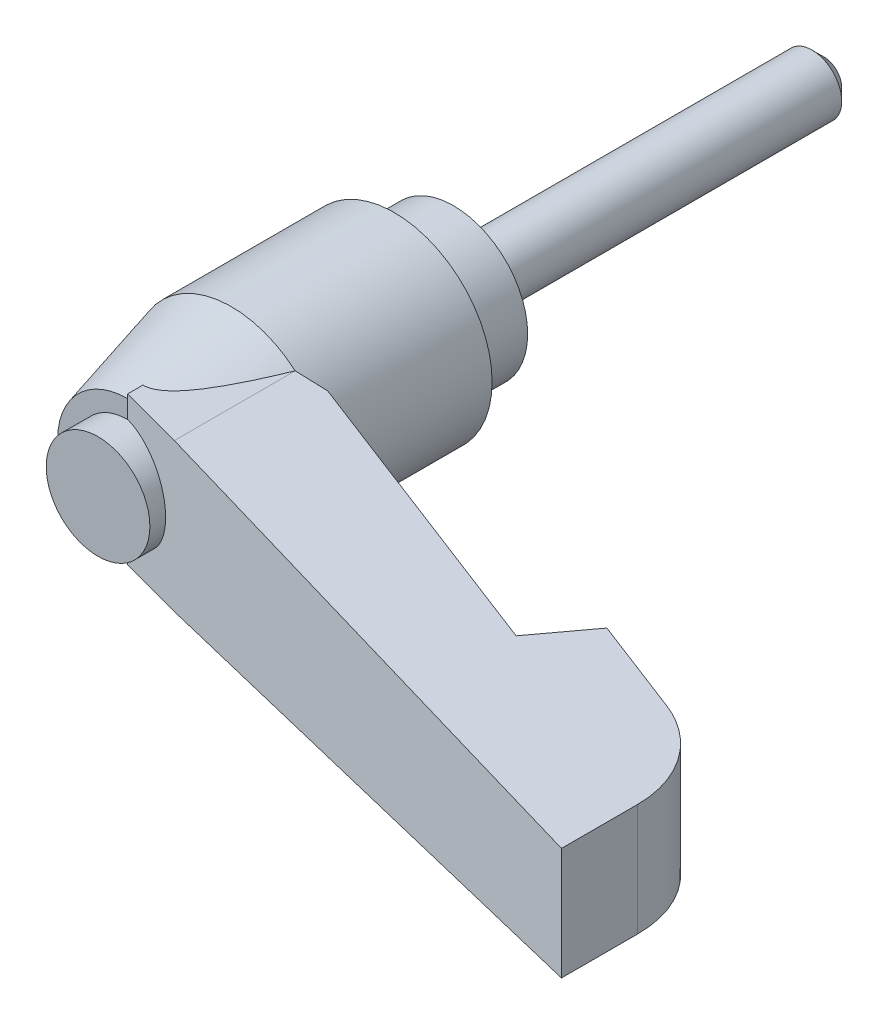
ISO-10303-21;
HEADER;
FILE_DESCRIPTION(('STEP AP214'),'2;1');
FILE_NAME('part.step','',(''),(''),'','','');
FILE_SCHEMA(('AUTOMOTIVE_DESIGN { 1 0 10303 214 1 1 1 1 }'));
ENDSEC;
DATA;
#1=APPLICATION_CONTEXT('core data for automotive mechanical design processes');
#2=APPLICATION_PROTOCOL_DEFINITION('international standard','automotive_design',2000,#1);
#3=PRODUCT_CONTEXT('',#1,'mechanical');
#4=PRODUCT('Part','Part','',(#3));
#5=PRODUCT_RELATED_PRODUCT_CATEGORY('part','',(#4));
#6=PRODUCT_DEFINITION_FORMATION('','',#4);
#7=PRODUCT_DEFINITION_CONTEXT('part definition',#1,'design');
#8=PRODUCT_DEFINITION('design','',#6,#7);
#9=PRODUCT_DEFINITION_SHAPE('','',#8);
#10=(LENGTH_UNIT() NAMED_UNIT(*) SI_UNIT(.MILLI.,.METRE.));
#11=(NAMED_UNIT(*) PLANE_ANGLE_UNIT() SI_UNIT($,.RADIAN.));
#12=(NAMED_UNIT(*) SI_UNIT($,.STERADIAN.) SOLID_ANGLE_UNIT());
#13=UNCERTAINTY_MEASURE_WITH_UNIT(LENGTH_MEASURE(1.E-05),#10,'distance_accuracy_value','');
#14=(GEOMETRIC_REPRESENTATION_CONTEXT(3) GLOBAL_UNCERTAINTY_ASSIGNED_CONTEXT((#13)) GLOBAL_UNIT_ASSIGNED_CONTEXT((#10,
#11,#12)) REPRESENTATION_CONTEXT('',''));
#15=CARTESIAN_POINT('',(0.,0.,0.));
#16=DIRECTION('',(0.,0.,1.));
#17=DIRECTION('',(1.,0.,0.));
#18=AXIS2_PLACEMENT_3D('',#15,#16,#17);
#19=CARTESIAN_POINT('',(2.024,-2.030964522,-25.));
#20=DIRECTION('',(0.,0.,-1.));
#21=DIRECTION('',(-1.,0.,0.));
#22=AXIS2_PLACEMENT_3D('',#19,#20,#21);
#23=PLANE('',#22);
#24=CARTESIAN_POINT('',(0.,0.,-25.));
#25=DIRECTION('',(0.,0.,-1.));
#26=DIRECTION('',(-1.,0.,0.));
#27=AXIS2_PLACEMENT_3D('',#24,#25,#26);
#28=CIRCLE('',#27,1.19999999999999);
#29=CARTESIAN_POINT('',(-1.19999999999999,0.,-25.));
#30=VERTEX_POINT('',#29);
#31=EDGE_CURVE('E9',#30,#30,#28,.T.);
#32=ORIENTED_EDGE('',*,*,#31,.T.);
#33=EDGE_LOOP('',(#32));
#34=FACE_BOUND('',#33,.T.);
#35=ADVANCED_FACE('F14',(#34),#23,.T.);
#36=CARTESIAN_POINT('',(0.,0.,-25.));
#37=DIRECTION('',(0.,0.,1.));
#38=DIRECTION('',(1.,0.,0.));
#39=AXIS2_PLACEMENT_3D('',#36,#37,#38);
#40=CYLINDRICAL_SURFACE('',#39,2.);
#41=CARTESIAN_POINT('',(0.,0.,-24.2));
#42=DIRECTION('',(0.,0.,-1.));
#43=DIRECTION('',(-1.,0.,0.));
#44=AXIS2_PLACEMENT_3D('',#41,#42,#43);
#45=CIRCLE('',#44,2.);
#46=CARTESIAN_POINT('',(-2.,0.,-24.2));
#47=VERTEX_POINT('',#46);
#48=EDGE_CURVE('E23',#47,#47,#45,.F.);
#49=ORIENTED_EDGE('',*,*,#48,.T.);
#50=EDGE_LOOP('',(#49));
#51=FACE_BOUND('',#50,.T.);
#52=CARTESIAN_POINT('',(0.,0.,0.));
#53=DIRECTION('',(0.,0.,1.));
#54=DIRECTION('',(1.,0.,0.));
#55=AXIS2_PLACEMENT_3D('',#52,#53,#54);
#56=CIRCLE('',#55,2.);
#57=CARTESIAN_POINT('',(2.,0.,0.));
#58=VERTEX_POINT('',#57);
#59=EDGE_CURVE('E143',#58,#58,#56,.F.);
#60=ORIENTED_EDGE('',*,*,#59,.T.);
#61=EDGE_LOOP('',(#60));
#62=FACE_BOUND('',#61,.T.);
#63=ADVANCED_FACE('F367',(#51,#62),#40,.T.);
#64=CARTESIAN_POINT('',(-5.06,-5.077411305,0.));
#65=DIRECTION('',(0.,0.,1.));
#66=DIRECTION('',(1.,0.,0.));
#67=AXIS2_PLACEMENT_3D('',#64,#65,#66);
#68=PLANE('',#67);
#69=ORIENTED_EDGE('',*,*,#59,.F.);
#70=EDGE_LOOP('',(#69));
#71=FACE_BOUND('',#70,.T.);
#72=CARTESIAN_POINT('',(0.,0.,0.));
#73=DIRECTION('',(0.,0.,1.));
#74=DIRECTION('',(1.,0.,0.));
#75=AXIS2_PLACEMENT_3D('',#72,#73,#74);
#76=CIRCLE('',#75,5.);
#77=CARTESIAN_POINT('',(5.,0.,0.));
#78=VERTEX_POINT('',#77);
#79=EDGE_CURVE('E122',#78,#78,#76,.T.);
#80=ORIENTED_EDGE('',*,*,#79,.F.);
#81=EDGE_LOOP('',(#80));
#82=FACE_BOUND('',#81,.T.);
#83=ADVANCED_FACE('F369',(#71,#82),#68,.F.);
#84=CARTESIAN_POINT('',(-3.542,-3.554187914,24.));
#85=DIRECTION('',(0.,0.,1.));
#86=DIRECTION('',(1.,0.,0.));
#87=AXIS2_PLACEMENT_3D('',#84,#85,#86);
#88=PLANE('',#87);
#89=CARTESIAN_POINT('',(0.,0.,24.));
#90=DIRECTION('',(0.,0.,1.));
#91=DIRECTION('',(1.,0.,0.));
#92=AXIS2_PLACEMENT_3D('',#89,#90,#91);
#93=CIRCLE('',#92,3.5);
#94=CARTESIAN_POINT('',(3.5,0.,24.));
#95=VERTEX_POINT('',#94);
#96=EDGE_CURVE('E208',#95,#95,#93,.F.);
#97=ORIENTED_EDGE('',*,*,#96,.F.);
#98=EDGE_LOOP('',(#97));
#99=FACE_BOUND('',#98,.T.);
#100=ADVANCED_FACE('F365',(#99),#88,.T.);
#101=CARTESIAN_POINT('',(0.,0.,0.));
#102=DIRECTION('',(0.,0.,1.));
#103=DIRECTION('',(1.,0.,0.));
#104=AXIS2_PLACEMENT_3D('',#101,#102,#103);
#105=CYLINDRICAL_SURFACE('',#104,5.);
#106=CARTESIAN_POINT('',(0.,0.,4.));
#107=DIRECTION('',(0.,0.,1.));
#108=DIRECTION('',(1.,0.,0.));
#109=AXIS2_PLACEMENT_3D('',#106,#107,#108);
#110=CIRCLE('',#109,5.);
#111=CARTESIAN_POINT('',(5.,0.,4.));
#112=VERTEX_POINT('',#111);
#113=EDGE_CURVE('E273',#112,#112,#110,.F.);
#114=ORIENTED_EDGE('',*,*,#113,.T.);
#115=EDGE_LOOP('',(#114));
#116=FACE_BOUND('',#115,.T.);
#117=ORIENTED_EDGE('',*,*,#79,.T.);
#118=EDGE_LOOP('',(#117));
#119=FACE_BOUND('',#118,.T.);
#120=ADVANCED_FACE('F362',(#116,#119),#105,.T.);
#121=CARTESIAN_POINT('',(6.5,1.121419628,15.));
#122=DIRECTION('',(0.,0.,-1.));
#123=DIRECTION('',(-1.,0.,0.));
#124=AXIS2_PLACEMENT_3D('',#121,#122,#123);
#125=PLANE('',#124);
#126=DIRECTION('',(-0.999423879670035,0.0339397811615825,0.));
#127=VECTOR('',#126,1.);
#128=CARTESIAN_POINT('',(22.154065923,4.393963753,15.));
#129=LINE('',#128,#127);
#130=CARTESIAN_POINT('',(6.4999999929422,4.9255655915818,15.));
#131=VERTEX_POINT('',#130);
#132=CARTESIAN_POINT('',(4.30813184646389,4.99999999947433,15.0000000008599));
#133=VERTEX_POINT('',#132);
#134=EDGE_CURVE('E206',#131,#133,#129,.T.);
#135=ORIENTED_EDGE('',*,*,#134,.F.);
#136=DIRECTION('',(0.,1.,0.));
#137=VECTOR('',#136,1.);
#138=CARTESIAN_POINT('',(6.5,0.,15.));
#139=LINE('',#138,#137);
#140=CARTESIAN_POINT('',(6.5,1.14455231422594,15.));
#141=VERTEX_POINT('',#140);
#142=EDGE_CURVE('E203',#141,#131,#139,.T.);
#143=ORIENTED_EDGE('',*,*,#142,.F.);
#144=CARTESIAN_POINT('',(0.,0.,15.));
#145=DIRECTION('',(0.,0.,1.));
#146=DIRECTION('',(1.,0.,0.));
#147=AXIS2_PLACEMENT_3D('',#144,#145,#146);
#148=CIRCLE('',#147,6.6);
#149=EDGE_CURVE('E284',#133,#141,#148,.F.);
#150=ORIENTED_EDGE('',*,*,#149,.F.);
#151=EDGE_LOOP('',(#135,#143,#150));
#152=FACE_BOUND('',#151,.T.);
#153=ADVANCED_FACE('F283',(#152),#125,.T.);
#154=CARTESIAN_POINT('',(33.,3.991671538,27.571700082));
#155=DIRECTION('',(0.,-1.,0.));
#156=DIRECTION('',(0.,0.,-1.));
#157=AXIS2_PLACEMENT_3D('',#154,#155,#156);
#158=CYLINDRICAL_SURFACE('',#157,7.);
#159=CARTESIAN_POINT('',(33.,4.02564292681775,27.571700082));
#160=DIRECTION('',(0.0339397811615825,0.999423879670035,0.));
#161=DIRECTION('',(0.999423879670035,-0.0339397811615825,0.));
#162=AXIS2_PLACEMENT_3D('',#159,#160,#161);
#163=ELLIPSE('',#162,7.00403516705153,7.);
#164=CARTESIAN_POINT('',(40.,3.787927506,27.571700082));
#165=VERTEX_POINT('',#164);
#166=CARTESIAN_POINT('',(35.3941410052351,3.94433946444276,20.9938517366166));
#167=VERTEX_POINT('',#166);
#168=EDGE_CURVE('E115',#165,#167,#163,.T.);
#169=ORIENTED_EDGE('',*,*,#168,.F.);
#170=DIRECTION('',(0.,-1.,0.));
#171=VECTOR('',#170,1.);
#172=CARTESIAN_POINT('',(40.,0.,27.571700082));
#173=LINE('',#172,#171);
#174=CARTESIAN_POINT('',(40.,-3.787927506,27.571700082));
#175=VERTEX_POINT('',#174);
#176=EDGE_CURVE('E106',#165,#175,#173,.T.);
#177=ORIENTED_EDGE('',*,*,#176,.T.);
#178=CARTESIAN_POINT('',(33.,-4.02564292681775,27.571700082));
#179=DIRECTION('',(-0.0339397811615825,0.999423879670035,0.));
#180=DIRECTION('',(-0.999423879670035,-0.0339397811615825,0.));
#181=AXIS2_PLACEMENT_3D('',#178,#179,#180);
#182=ELLIPSE('',#181,7.00403516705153,7.);
#183=CARTESIAN_POINT('',(35.3941410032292,-3.94433946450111,20.9938517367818));
#184=VERTEX_POINT('',#183);
#185=EDGE_CURVE('E118',#175,#184,#182,.T.);
#186=ORIENTED_EDGE('',*,*,#185,.T.);
#187=DIRECTION('',(0.,-1.,0.));
#188=VECTOR('',#187,1.);
#189=CARTESIAN_POINT('',(35.394141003,0.,20.993851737));
#190=LINE('',#189,#188);
#191=EDGE_CURVE('E111',#167,#184,#190,.T.);
#192=ORIENTED_EDGE('',*,*,#191,.F.);
#193=EDGE_LOOP('',(#169,#177,#186,#192));
#194=FACE_BOUND('',#193,.T.);
#195=ADVANCED_FACE('F113',(#194),#158,.T.);
#196=CARTESIAN_POINT('',(35.394141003,-4.210603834,20.993851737));
#197=DIRECTION('',(0.342020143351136,0.,-0.939692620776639));
#198=DIRECTION('',(-0.939692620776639,0.,-0.342020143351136));
#199=AXIS2_PLACEMENT_3D('',#196,#197,#198);
#200=PLANE('',#199);
#201=DIRECTION('',(-0.939214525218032,0.0318951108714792,-0.341846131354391));
#202=VECTOR('',#201,1.);
#203=CARTESIAN_POINT('',(35.3941410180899,3.944339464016,20.9938517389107));
#204=LINE('',#203,#202);
#205=CARTESIAN_POINT('',(29.0236925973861,4.16067572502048,18.67519813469));
#206=VERTEX_POINT('',#205);
#207=EDGE_CURVE('E125',#167,#206,#204,.T.);
#208=ORIENTED_EDGE('',*,*,#207,.F.);
#209=ORIENTED_EDGE('',*,*,#191,.T.);
#210=DIRECTION('',(-0.939214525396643,-0.0318951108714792,-0.341846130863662));
#211=VECTOR('',#210,1.);
#212=CARTESIAN_POINT('',(35.3941410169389,-3.944339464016,20.9938517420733));
#213=LINE('',#212,#211);
#214=CARTESIAN_POINT('',(29.023692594,-4.16067572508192,18.675198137));
#215=VERTEX_POINT('',#214);
#216=EDGE_CURVE('E300',#184,#215,#213,.T.);
#217=ORIENTED_EDGE('',*,*,#216,.T.);
#218=DIRECTION('',(0.,-1.,0.));
#219=VECTOR('',#218,1.);
#220=CARTESIAN_POINT('',(29.023692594,0.,18.675198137));
#221=LINE('',#220,#219);
#222=EDGE_CURVE('E121',#206,#215,#221,.T.);
#223=ORIENTED_EDGE('',*,*,#222,.F.);
#224=EDGE_LOOP('',(#208,#209,#217,#223));
#225=FACE_BOUND('',#224,.T.);
#226=ADVANCED_FACE('F126',(#225),#200,.T.);
#227=CARTESIAN_POINT('',(29.023692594,-4.297335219,18.675198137));
#228=DIRECTION('',(-0.819152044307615,0.,-0.57357643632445));
#229=DIRECTION('',(-0.57357643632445,0.,0.819152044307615));
#230=AXIS2_PLACEMENT_3D('',#227,#228,#229);
#231=PLANE('',#230);
#232=DIRECTION('',(-0.573467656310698,0.0194745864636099,0.818996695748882));
#233=VECTOR('',#232,1.);
#234=CARTESIAN_POINT('',(29.0236925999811,4.16067572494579,18.675198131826));
#235=LINE('',#234,#233);
#236=CARTESIAN_POINT('',(26.5000000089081,4.2463786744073,22.2794046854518));
#237=VERTEX_POINT('',#236);
#238=EDGE_CURVE('E131',#206,#237,#235,.T.);
#239=ORIENTED_EDGE('',*,*,#238,.F.);
#240=ORIENTED_EDGE('',*,*,#222,.T.);
#241=DIRECTION('',(-0.573467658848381,-0.0194745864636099,0.818996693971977));
#242=VECTOR('',#241,1.);
#243=CARTESIAN_POINT('',(29.0236925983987,-4.16067572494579,18.675198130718));
#244=LINE('',#243,#242);
#245=CARTESIAN_POINT('',(26.5,-4.24637867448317,22.279404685));
#246=VERTEX_POINT('',#245);
#247=EDGE_CURVE('E302',#215,#246,#244,.T.);
#248=ORIENTED_EDGE('',*,*,#247,.T.);
#249=DIRECTION('',(0.,-1.,0.));
#250=VECTOR('',#249,1.);
#251=CARTESIAN_POINT('',(26.5,0.,22.279404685));
#252=LINE('',#251,#250);
#253=EDGE_CURVE('E200',#237,#246,#252,.T.);
#254=ORIENTED_EDGE('',*,*,#253,.F.);
#255=EDGE_LOOP('',(#239,#240,#248,#254));
#256=FACE_BOUND('',#255,.T.);
#257=ADVANCED_FACE('F507',(#256),#231,.T.);
#258=CARTESIAN_POINT('',(26.5,-4.984672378,22.279404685));
#259=DIRECTION('',(0.342020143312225,0.,-0.939692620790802));
#260=DIRECTION('',(-0.939692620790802,0.,-0.342020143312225));
#261=AXIS2_PLACEMENT_3D('',#258,#259,#260);
#262=PLANE('',#261);
#263=DIRECTION('',(-0.939214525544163,0.0318951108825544,-0.341846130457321));
#264=VECTOR('',#263,1.);
#265=CARTESIAN_POINT('',(26.5000000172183,4.24637867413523,22.2794046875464));
#266=LINE('',#265,#264);
#267=EDGE_CURVE('E209',#237,#131,#266,.T.);
#268=ORIENTED_EDGE('',*,*,#267,.F.);
#269=ORIENTED_EDGE('',*,*,#253,.T.);
#270=DIRECTION('',(-0.939214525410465,-0.0318951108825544,-0.34184613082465));
#271=VECTOR('',#270,1.);
#272=CARTESIAN_POINT('',(26.5000000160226,-4.24637867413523,22.2794046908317));
#273=LINE('',#272,#271);
#274=CARTESIAN_POINT('',(6.5,-4.92556559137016,15.));
#275=VERTEX_POINT('',#274);
#276=EDGE_CURVE('E172',#246,#275,#273,.T.);
#277=ORIENTED_EDGE('',*,*,#276,.T.);
#278=DIRECTION('',(0.,-1.,0.));
#279=VECTOR('',#278,1.);
#280=CARTESIAN_POINT('',(6.5,-3.072276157,15.));
#281=LINE('',#280,#279);
#282=CARTESIAN_POINT('',(6.50000000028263,-1.1445523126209,15.));
#283=VERTEX_POINT('',#282);
#284=EDGE_CURVE('E265',#283,#275,#281,.T.);
#285=ORIENTED_EDGE('',*,*,#284,.F.);
#286=CARTESIAN_POINT('',(-0.712266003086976,0.,12.3749498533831));
#287=DIRECTION('',(0.342020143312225,0.,-0.939692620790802));
#288=DIRECTION('',(-0.939692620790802,0.,-0.342020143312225));
#289=AXIS2_PLACEMENT_3D('',#286,#287,#288);
#290=ELLIPSE('',#289,7.77209472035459,7.26856501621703);
#291=CARTESIAN_POINT('',(6.59542722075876,-3.94812923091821E-10,15.0145038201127));
#292=VERTEX_POINT('',#291);
#293=EDGE_CURVE('E31',#292,#283,#290,.T.);
#294=ORIENTED_EDGE('',*,*,#293,.F.);
#295=CARTESIAN_POINT('',(0.,0.,12.634193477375));
#296=DIRECTION('',(0.342020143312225,0.,-0.939692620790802));
#297=DIRECTION('',(0.939692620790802,0.,0.342020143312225));
#298=AXIS2_PLACEMENT_3D('',#295,#296,#297);
#299=ELLIPSE('',#298,7.02357329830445,6.6);
#300=EDGE_CURVE('E279',#141,#292,#299,.T.);
#301=ORIENTED_EDGE('',*,*,#300,.F.);
#302=ORIENTED_EDGE('',*,*,#142,.T.);
#303=EDGE_LOOP('',(#268,#269,#277,#285,#294,#301,#302));
#304=FACE_BOUND('',#303,.T.);
#305=ADVANCED_FACE('F277',(#304),#262,.T.);
#306=CARTESIAN_POINT('',(40.,-3.787927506,27.571700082));
#307=DIRECTION('',(-1.,0.,0.));
#308=DIRECTION('',(0.,0.,1.));
#309=AXIS2_PLACEMENT_3D('',#306,#307,#308);
#310=PLANE('',#309);
#311=DIRECTION('',(0.,0.,-1.));
#312=VECTOR('',#311,1.);
#313=CARTESIAN_POINT('',(40.,-3.787927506,23.9121377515));
#314=LINE('',#313,#312);
#315=CARTESIAN_POINT('',(40.,-3.787927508,32.717967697));
#316=VERTEX_POINT('',#315);
#317=EDGE_CURVE('E263',#316,#175,#314,.T.);
#318=ORIENTED_EDGE('',*,*,#317,.T.);
#319=ORIENTED_EDGE('',*,*,#176,.F.);
#320=DIRECTION('',(0.,0.,-1.));
#321=VECTOR('',#320,1.);
#322=CARTESIAN_POINT('',(40.,3.787927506,23.9121377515));
#323=LINE('',#322,#321);
#324=CARTESIAN_POINT('',(40.,3.787927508,32.717967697));
#325=VERTEX_POINT('',#324);
#326=EDGE_CURVE('E136',#325,#165,#323,.T.);
#327=ORIENTED_EDGE('',*,*,#326,.F.);
#328=DIRECTION('',(0.,1.,0.));
#329=VECTOR('',#328,1.);
#330=CARTESIAN_POINT('',(40.,0.,32.717967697));
#331=LINE('',#330,#329);
#332=EDGE_CURVE('E197',#316,#325,#331,.T.);
#333=ORIENTED_EDGE('',*,*,#332,.F.);
#334=EDGE_LOOP('',(#318,#319,#327,#333));
#335=FACE_BOUND('',#334,.T.);
#336=ADVANCED_FACE('F525',(#335),#310,.F.);
#337=CARTESIAN_POINT('',(40.,3.787927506,15.));
#338=DIRECTION('',(0.0339397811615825,0.999423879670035,0.));
#339=DIRECTION('',(-0.999423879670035,0.0339397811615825,0.));
#340=AXIS2_PLACEMENT_3D('',#337,#338,#339);
#341=PLANE('',#340);
#342=ORIENTED_EDGE('',*,*,#267,.T.);
#343=ORIENTED_EDGE('',*,*,#134,.T.);
#344=DIRECTION('',(0.,0.,1.));
#345=VECTOR('',#344,1.);
#346=CARTESIAN_POINT('',(4.308131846,5.,19.0771802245));
#347=LINE('',#346,#345);
#348=CARTESIAN_POINT('',(4.30813184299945,5.,23.1543604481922));
#349=VERTEX_POINT('',#348);
#350=EDGE_CURVE('E272',#133,#349,#347,.T.);
#351=ORIENTED_EDGE('',*,*,#350,.T.);
#352=DIRECTION('',(-0.965406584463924,0.0327845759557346,-0.258679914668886));
#353=VECTOR('',#352,1.);
#354=CARTESIAN_POINT('',(40.,3.78792751,32.717967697));
#355=LINE('',#354,#353);
#356=EDGE_CURVE('E194',#325,#349,#355,.T.);
#357=ORIENTED_EDGE('',*,*,#356,.F.);
#358=ORIENTED_EDGE('',*,*,#326,.T.);
#359=ORIENTED_EDGE('',*,*,#168,.T.);
#360=ORIENTED_EDGE('',*,*,#207,.T.);
#361=ORIENTED_EDGE('',*,*,#238,.T.);
#362=EDGE_LOOP('',(#342,#343,#351,#357,#358,#359,#360,#361));
#363=FACE_BOUND('',#362,.T.);
#364=ADVANCED_FACE('F134',(#363),#341,.T.);
#365=CARTESIAN_POINT('',(0.,0.,22.));
#366=DIRECTION('',(0.,0.,1.));
#367=DIRECTION('',(1.,0.,0.));
#368=AXIS2_PLACEMENT_3D('',#365,#366,#367);
#369=CYLINDRICAL_SURFACE('',#368,3.5);
#370=CARTESIAN_POINT('',(0.,0.,22.));
#371=DIRECTION('',(-0.258819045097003,0.,0.965925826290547));
#372=DIRECTION('',(0.965925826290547,0.,0.258819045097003));
#373=AXIS2_PLACEMENT_3D('',#370,#371,#372);
#374=ELLIPSE('',#373,3.62346663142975,3.5);
#375=CARTESIAN_POINT('',(0.,3.5,22.));
#376=VERTEX_POINT('',#375);
#377=CARTESIAN_POINT('',(0.,-3.5,22.));
#378=VERTEX_POINT('',#377);
#379=EDGE_CURVE('E188',#376,#378,#374,.F.);
#380=ORIENTED_EDGE('',*,*,#379,.F.);
#381=CARTESIAN_POINT('',(0.,0.,22.));
#382=DIRECTION('',(0.,0.,1.));
#383=DIRECTION('',(1.,0.,0.));
#384=AXIS2_PLACEMENT_3D('',#381,#382,#383);
#385=CIRCLE('',#384,3.5);
#386=EDGE_CURVE('E254',#376,#378,#385,.T.);
#387=ORIENTED_EDGE('',*,*,#386,.T.);
#388=EDGE_LOOP('',(#380,#387));
#389=FACE_BOUND('',#388,.T.);
#390=ORIENTED_EDGE('',*,*,#96,.T.);
#391=EDGE_LOOP('',(#390));
#392=FACE_BOUND('',#391,.T.);
#393=ADVANCED_FACE('F356',(#389,#392),#369,.T.);
#394=CARTESIAN_POINT('',(0.,4.722701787,20.96510898));
#395=DIRECTION('',(-1.,0.,0.));
#396=DIRECTION('',(0.,0.,1.));
#397=AXIS2_PLACEMENT_3D('',#394,#395,#396);
#398=PLANE('',#397);
#399=DIRECTION('',(0.,-1.,0.));
#400=VECTOR('',#399,1.);
#401=CARTESIAN_POINT('',(0.,0.,22.));
#402=LINE('',#401,#400);
#403=CARTESIAN_POINT('',(0.,5.,22.00000000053));
#404=VERTEX_POINT('',#403);
#405=CARTESIAN_POINT('',(4.8449077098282E-10,4.7243556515,22.));
#406=VERTEX_POINT('',#405);
#407=EDGE_CURVE('E185',#404,#406,#402,.T.);
#408=ORIENTED_EDGE('',*,*,#407,.F.);
#409=DIRECTION('',(0.,0.,-1.));
#410=VECTOR('',#409,1.);
#411=CARTESIAN_POINT('',(0.,5.,19.0771802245));
#412=LINE('',#411,#410);
#413=CARTESIAN_POINT('',(2.56379285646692E-10,5.,20.9712812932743));
#414=VERTEX_POINT('',#413);
#415=EDGE_CURVE('E270',#404,#414,#412,.T.);
#416=ORIENTED_EDGE('',*,*,#415,.T.);
#417=DIRECTION('',(5.3084673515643E-11,0.258819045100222,-0.965925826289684));
#418=VECTOR('',#417,1.);
#419=CARTESIAN_POINT('',(1.16133208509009E-09,5.6621778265,18.5));
#420=LINE('',#419,#418);
#421=EDGE_CURVE('E180',#406,#414,#420,.T.);
#422=ORIENTED_EDGE('',*,*,#421,.F.);
#423=EDGE_LOOP('',(#408,#416,#422));
#424=FACE_BOUND('',#423,.T.);
#425=ADVANCED_FACE('F323',(#424),#398,.T.);
#426=CARTESIAN_POINT('',(0.,5.,23.203286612));
#427=DIRECTION('',(0.,-1.,0.));
#428=DIRECTION('',(0.,0.,-1.));
#429=AXIS2_PLACEMENT_3D('',#426,#427,#428);
#430=PLANE('',#429);
#431=ORIENTED_EDGE('',*,*,#350,.F.);
#432=CARTESIAN_POINT('',(5.12758570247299E-10,4.99999999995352,20.9712812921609));
#433=CARTESIAN_POINT('',(0.0452169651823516,4.99999999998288,20.9713050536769));
#434=CARTESIAN_POINT('',(0.0904012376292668,4.99999999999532,20.9689904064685));
#435=CARTESIAN_POINT('',(0.180236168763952,5.00000000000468,20.9599070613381));
#436=CARTESIAN_POINT('',(0.224887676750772,5.00000000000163,20.9531468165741));
#437=CARTESIAN_POINT('',(0.355879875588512,4.9999999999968,20.9268621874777));
#438=CARTESIAN_POINT('',(0.441043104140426,4.99999999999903,20.9013147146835));
#439=CARTESIAN_POINT('',(0.632227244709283,5.00000000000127,20.8270446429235));
#440=CARTESIAN_POINT('',(0.736330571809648,5.00000000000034,20.7735488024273));
#441=CARTESIAN_POINT('',(0.935669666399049,4.99999999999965,20.6509465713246));
#442=CARTESIAN_POINT('',(1.03082413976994,4.9999999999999,20.5817135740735));
#443=CARTESIAN_POINT('',(1.23366330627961,5.00000000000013,20.4160087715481));
#444=CARTESIAN_POINT('',(1.33918187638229,5.00000000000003,20.3169366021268));
#445=CARTESIAN_POINT('',(1.54038525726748,4.99999999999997,20.1091453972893));
#446=CARTESIAN_POINT('',(1.63605047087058,4.99999999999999,20.0004079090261));
#447=CARTESIAN_POINT('',(1.82048892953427,5.00000000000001,19.7755785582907));
#448=CARTESIAN_POINT('',(1.9091882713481,5.,19.6594267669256));
#449=CARTESIAN_POINT('',(2.08029219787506,5.,19.4227906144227));
#450=CARTESIAN_POINT('',(2.16270259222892,5.,19.302310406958));
#451=CARTESIAN_POINT('',(2.35274250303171,5.,19.0120714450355));
#452=CARTESIAN_POINT('',(2.4581571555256,5.,18.8408691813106));
#453=CARTESIAN_POINT('',(2.66191601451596,5.,18.494284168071));
#454=CARTESIAN_POINT('',(2.76025796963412,5.,18.3189001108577));
#455=CARTESIAN_POINT('',(2.95155424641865,5.,17.9648132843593));
#456=CARTESIAN_POINT('',(3.04449826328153,5.,17.7861049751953));
#457=CARTESIAN_POINT('',(3.22591068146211,5.,17.4264286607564));
#458=CARTESIAN_POINT('',(3.31437881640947,5.,17.2454605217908));
#459=CARTESIAN_POINT('',(3.48198701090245,5.,16.8936485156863));
#460=CARTESIAN_POINT('',(3.56135902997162,5.,16.7229147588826));
#461=CARTESIAN_POINT('',(3.71739787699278,5.,16.3802085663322));
#462=CARTESIAN_POINT('',(3.79406458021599,5.,16.2082360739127));
#463=CARTESIAN_POINT('',(3.94476452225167,5.,15.8640185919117));
#464=CARTESIAN_POINT('',(4.01880761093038,5.,15.6917779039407));
#465=CARTESIAN_POINT('',(4.16489312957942,5.,15.3464724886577));
#466=CARTESIAN_POINT('',(4.23693578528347,5.,15.1734078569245));
#467=CARTESIAN_POINT('',(4.3081318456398,5.,15.0000000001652));
#468=B_SPLINE_CURVE_WITH_KNOTS('',3,(#432,#433,#434,#435,#436,#437,#438,#439,#440,#441,#442,
#443,#444,#445,#446,#447,#448,#449,#450,#451,#452,#453,#454,#455,#456,#457,#458,#459,#460,#461,
#462,#463,#464,#465,#466,#467),.UNSPECIFIED.,.F.,.F.,(4,2,2,2,2,2,2,2,2,2,2,2,2,2,2,2,2,4),(0.,
0.135533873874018,0.270810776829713,0.536101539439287,0.885260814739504,1.23733529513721,
1.67054898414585,2.10460829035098,2.54278097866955,2.98054386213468,3.58345671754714,
4.18656065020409,4.79078044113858,5.39503614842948,5.95985360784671,6.52469707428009,
7.08712785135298,7.6494949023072),.UNSPECIFIED.);
#469=EDGE_CURVE('E183',#414,#133,#468,.T.);
#470=ORIENTED_EDGE('',*,*,#469,.F.);
#471=ORIENTED_EDGE('',*,*,#415,.F.);
#472=DIRECTION('',(-0.965925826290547,0.,-0.258819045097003));
#473=VECTOR('',#472,1.);
#474=CARTESIAN_POINT('',(20.,5.,27.3589838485));
#475=LINE('',#474,#473);
#476=EDGE_CURVE('E189',#349,#404,#475,.T.);
#477=ORIENTED_EDGE('',*,*,#476,.F.);
#478=EDGE_LOOP('',(#431,#470,#471,#477));
#479=FACE_BOUND('',#478,.T.);
#480=ADVANCED_FACE('F317',(#479),#430,.F.);
#481=CARTESIAN_POINT('',(-6.6792,-6.702182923,4.));
#482=DIRECTION('',(0.,0.,1.));
#483=DIRECTION('',(1.,0.,0.));
#484=AXIS2_PLACEMENT_3D('',#481,#482,#483);
#485=PLANE('',#484);
#486=ORIENTED_EDGE('',*,*,#113,.F.);
#487=EDGE_LOOP('',(#486));
#488=FACE_BOUND('',#487,.T.);
#489=CARTESIAN_POINT('',(0.,0.,4.));
#490=DIRECTION('',(0.,0.,1.));
#491=DIRECTION('',(1.,0.,0.));
#492=AXIS2_PLACEMENT_3D('',#489,#490,#491);
#493=CIRCLE('',#492,6.6);
#494=CARTESIAN_POINT('',(6.6,0.,4.));
#495=VERTEX_POINT('',#494);
#496=EDGE_CURVE('E177',#495,#495,#493,.T.);
#497=ORIENTED_EDGE('',*,*,#496,.F.);
#498=EDGE_LOOP('',(#497));
#499=FACE_BOUND('',#498,.T.);
#500=ADVANCED_FACE('F322',(#488,#499),#485,.F.);
#501=CARTESIAN_POINT('',(0.,0.,15.022195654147));
#502=DIRECTION('',(0.,0.,-1.));
#503=DIRECTION('',(-1.,0.,0.));
#504=AXIS2_PLACEMENT_3D('',#501,#502,#503);
#505=CONICAL_SURFACE('',#504,6.594052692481,0.261799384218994);
#506=CARTESIAN_POINT('',(0.,0.,15.));
#507=DIRECTION('',(0.,0.,1.));
#508=DIRECTION('',(1.,0.,0.));
#509=AXIS2_PLACEMENT_3D('',#506,#507,#508);
#510=CIRCLE('',#509,6.6);
#511=EDGE_CURVE('E173',#292,#283,#510,.F.);
#512=ORIENTED_EDGE('',*,*,#511,.F.);
#513=ORIENTED_EDGE('',*,*,#293,.T.);
#514=EDGE_LOOP('',(#512,#513));
#515=FACE_BOUND('',#514,.T.);
#516=ADVANCED_FACE('F328',(#515),#505,.T.);
#517=CARTESIAN_POINT('',(6.5,-5.023132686,15.));
#518=DIRECTION('',(0.,0.,-1.));
#519=DIRECTION('',(-1.,0.,0.));
#520=AXIS2_PLACEMENT_3D('',#517,#518,#519);
#521=PLANE('',#520);
#522=CARTESIAN_POINT('',(0.,0.,15.));
#523=DIRECTION('',(0.,0.,1.));
#524=DIRECTION('',(1.,0.,0.));
#525=AXIS2_PLACEMENT_3D('',#522,#523,#524);
#526=CIRCLE('',#525,6.6);
#527=CARTESIAN_POINT('',(4.30813184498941,-5.00000000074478,14.9999999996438));
#528=VERTEX_POINT('',#527);
#529=EDGE_CURVE('E176',#283,#528,#526,.F.);
#530=ORIENTED_EDGE('',*,*,#529,.F.);
#531=ORIENTED_EDGE('',*,*,#284,.T.);
#532=DIRECTION('',(-0.999423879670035,-0.0339397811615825,0.));
#533=VECTOR('',#532,1.);
#534=CARTESIAN_POINT('',(22.154065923,-4.393963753,15.));
#535=LINE('',#534,#533);
#536=EDGE_CURVE('E169',#275,#528,#535,.T.);
#537=ORIENTED_EDGE('',*,*,#536,.T.);
#538=EDGE_LOOP('',(#530,#531,#537));
#539=FACE_BOUND('',#538,.T.);
#540=ADVANCED_FACE('F330',(#539),#521,.T.);
#541=CARTESIAN_POINT('',(40.,-3.787927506,15.));
#542=DIRECTION('',(-0.0339397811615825,0.999423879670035,0.));
#543=DIRECTION('',(-0.999423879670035,-0.0339397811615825,0.));
#544=AXIS2_PLACEMENT_3D('',#541,#542,#543);
#545=PLANE('',#544);
#546=DIRECTION('',(0.,0.,1.));
#547=VECTOR('',#546,1.);
#548=CARTESIAN_POINT('',(4.308131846,-5.,19.0771802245));
#549=LINE('',#548,#547);
#550=CARTESIAN_POINT('',(4.30813184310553,-4.99999999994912,23.1543604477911));
#551=VERTEX_POINT('',#550);
#552=EDGE_CURVE('E244',#528,#551,#549,.T.);
#553=ORIENTED_EDGE('',*,*,#552,.F.);
#554=ORIENTED_EDGE('',*,*,#536,.F.);
#555=ORIENTED_EDGE('',*,*,#276,.F.);
#556=ORIENTED_EDGE('',*,*,#247,.F.);
#557=ORIENTED_EDGE('',*,*,#216,.F.);
#558=ORIENTED_EDGE('',*,*,#185,.F.);
#559=ORIENTED_EDGE('',*,*,#317,.F.);
#560=DIRECTION('',(0.965406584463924,0.0327845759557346,0.258679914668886));
#561=VECTOR('',#560,1.);
#562=CARTESIAN_POINT('',(4.30813184,-5.,23.1543604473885));
#563=LINE('',#562,#561);
#564=EDGE_CURVE('E171',#551,#316,#563,.T.);
#565=ORIENTED_EDGE('',*,*,#564,.F.);
#566=EDGE_LOOP('',(#553,#554,#555,#556,#557,#558,#559,#565));
#567=FACE_BOUND('',#566,.T.);
#568=ADVANCED_FACE('F333',(#567),#545,.F.);
#569=CARTESIAN_POINT('',(0.,-5.,22.));
#570=DIRECTION('',(-0.258819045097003,0.,0.965925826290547));
#571=DIRECTION('',(0.965925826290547,0.,0.258819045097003));
#572=AXIS2_PLACEMENT_3D('',#569,#570,#571);
#573=PLANE('',#572);
#574=DIRECTION('',(0.,1.,0.));
#575=VECTOR('',#574,1.);
#576=CARTESIAN_POINT('',(0.,-4.8613508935,22.));
#577=LINE('',#576,#575);
#578=CARTESIAN_POINT('',(0.,-5.,22.0000000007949));
#579=VERTEX_POINT('',#578);
#580=CARTESIAN_POINT('',(9.0870570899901E-10,-4.72435565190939,22.));
#581=VERTEX_POINT('',#580);
#582=EDGE_CURVE('E164',#579,#581,#577,.T.);
#583=ORIENTED_EDGE('',*,*,#582,.F.);
#584=DIRECTION('',(-0.965925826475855,0.,-0.258819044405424));
#585=VECTOR('',#584,1.);
#586=CARTESIAN_POINT('',(4.308131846,-5.,23.1543604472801));
#587=LINE('',#586,#585);
#588=EDGE_CURVE('E165',#551,#579,#587,.T.);
#589=ORIENTED_EDGE('',*,*,#588,.F.);
#590=ORIENTED_EDGE('',*,*,#564,.T.);
#591=ORIENTED_EDGE('',*,*,#332,.T.);
#592=ORIENTED_EDGE('',*,*,#356,.T.);
#593=ORIENTED_EDGE('',*,*,#476,.T.);
#594=ORIENTED_EDGE('',*,*,#407,.T.);
#595=DIRECTION('',(0.,-1.,0.));
#596=VECTOR('',#595,1.);
#597=CARTESIAN_POINT('',(0.,0.,22.));
#598=LINE('',#597,#596);
#599=EDGE_CURVE('E257',#406,#376,#598,.T.);
#600=ORIENTED_EDGE('',*,*,#599,.T.);
#601=ORIENTED_EDGE('',*,*,#379,.T.);
#602=DIRECTION('',(0.,-1.,0.));
#603=VECTOR('',#602,1.);
#604=CARTESIAN_POINT('',(0.,0.,22.));
#605=LINE('',#604,#603);
#606=EDGE_CURVE('E184',#378,#581,#605,.T.);
#607=ORIENTED_EDGE('',*,*,#606,.T.);
#608=EDGE_LOOP('',(#583,#589,#590,#591,#592,#593,#594,#600,#601,#607));
#609=FACE_BOUND('',#608,.T.);
#610=ADVANCED_FACE('F247',(#609),#573,.T.);
#611=CARTESIAN_POINT('',(0.,-4.781047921,22.));
#612=DIRECTION('',(0.,0.,-1.));
#613=DIRECTION('',(-1.,0.,0.));
#614=AXIS2_PLACEMENT_3D('',#611,#612,#613);
#615=PLANE('',#614);
#616=CARTESIAN_POINT('',(0.,0.,22.));
#617=DIRECTION('',(0.,0.,-1.));
#618=DIRECTION('',(-1.,0.,0.));
#619=AXIS2_PLACEMENT_3D('',#616,#617,#618);
#620=CIRCLE('',#619,4.724355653);
#621=EDGE_CURVE('E168',#581,#406,#620,.T.);
#622=ORIENTED_EDGE('',*,*,#621,.F.);
#623=ORIENTED_EDGE('',*,*,#606,.F.);
#624=ORIENTED_EDGE('',*,*,#386,.F.);
#625=ORIENTED_EDGE('',*,*,#599,.F.);
#626=EDGE_LOOP('',(#622,#623,#624,#625));
#627=FACE_BOUND('',#626,.T.);
#628=ADVANCED_FACE('F229',(#627),#615,.F.);
#629=CARTESIAN_POINT('',(0.,0.,4.));
#630=DIRECTION('',(0.,0.,1.));
#631=DIRECTION('',(1.,0.,0.));
#632=AXIS2_PLACEMENT_3D('',#629,#630,#631);
#633=CYLINDRICAL_SURFACE('',#632,6.6);
#634=ORIENTED_EDGE('',*,*,#496,.T.);
#635=EDGE_LOOP('',(#634));
#636=FACE_BOUND('',#635,.T.);
#637=ORIENTED_EDGE('',*,*,#529,.T.);
#638=CARTESIAN_POINT('',(0.,0.,15.));
#639=DIRECTION('',(0.,0.,-1.));
#640=DIRECTION('',(-1.,0.,0.));
#641=AXIS2_PLACEMENT_3D('',#638,#639,#640);
#642=CIRCLE('',#641,6.6);
#643=EDGE_CURVE('E155',#133,#528,#642,.F.);
#644=ORIENTED_EDGE('',*,*,#643,.F.);
#645=ORIENTED_EDGE('',*,*,#149,.T.);
#646=ORIENTED_EDGE('',*,*,#300,.T.);
#647=ORIENTED_EDGE('',*,*,#511,.T.);
#648=EDGE_LOOP('',(#637,#644,#645,#646,#647));
#649=FACE_BOUND('',#648,.T.);
#650=ADVANCED_FACE('F227',(#636,#649),#633,.T.);
#651=CARTESIAN_POINT('',(0.,-5.,23.203286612));
#652=DIRECTION('',(0.,-1.,0.));
#653=DIRECTION('',(0.,0.,-1.));
#654=AXIS2_PLACEMENT_3D('',#651,#652,#653);
#655=PLANE('',#654);
#656=DIRECTION('',(0.,0.,1.));
#657=VECTOR('',#656,1.);
#658=CARTESIAN_POINT('',(0.,-5.,21.48255449));
#659=LINE('',#658,#657);
#660=CARTESIAN_POINT('',(9.61724492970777E-10,-5.,20.9712812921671));
#661=VERTEX_POINT('',#660);
#662=EDGE_CURVE('E161',#661,#579,#659,.T.);
#663=ORIENTED_EDGE('',*,*,#662,.F.);
#664=CARTESIAN_POINT('',(4.30813184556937,-4.99999999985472,15.0000000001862));
#665=CARTESIAN_POINT('',(4.22695317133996,-4.99999999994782,15.1977035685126));
#666=CARTESIAN_POINT('',(4.14468257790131,-4.99999999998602,15.3949657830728));
#667=CARTESIAN_POINT('',(3.97748181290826,-5.00000000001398,15.788403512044));
#668=CARTESIAN_POINT('',(3.89255113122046,-5.00000000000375,15.9845788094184));
#669=CARTESIAN_POINT('',(3.71969315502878,-4.99999999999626,16.3753187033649));
#670=CARTESIAN_POINT('',(3.63176972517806,-4.99999999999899,16.5698850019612));
#671=CARTESIAN_POINT('',(3.45219836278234,-5.00000000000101,16.9572716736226));
#672=CARTESIAN_POINT('',(3.36055072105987,-5.0000000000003,17.1500921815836));
#673=CARTESIAN_POINT('',(3.1396904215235,-4.99999999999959,17.6009656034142));
#674=CARTESIAN_POINT('',(3.00860107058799,-4.99999999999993,17.8581134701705));
#675=CARTESIAN_POINT('',(2.80337635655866,-5.00000000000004,18.23954911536));
#676=CARTESIAN_POINT('',(2.73346011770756,-5.00000000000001,18.3661077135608));
#677=CARTESIAN_POINT('',(2.59024232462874,-4.99999999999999,18.6172895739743));
#678=CARTESIAN_POINT('',(2.51694106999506,-5.,18.7419130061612));
#679=CARTESIAN_POINT('',(2.36662462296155,-5.,18.98807422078));
#680=CARTESIAN_POINT('',(2.28962938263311,-5.,19.1096241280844));
#681=CARTESIAN_POINT('',(2.1306979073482,-5.,19.3494323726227));
#682=CARTESIAN_POINT('',(2.04876288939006,-5.,19.4676915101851));
#683=CARTESIAN_POINT('',(1.87890565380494,-5.,19.6994333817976));
#684=CARTESIAN_POINT('',(1.79099818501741,-5.,19.8129268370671));
#685=CARTESIAN_POINT('',(1.60741923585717,-5.,20.0333897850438));
#686=CARTESIAN_POINT('',(1.51175533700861,-5.,20.1403654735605));
#687=CARTESIAN_POINT('',(1.32832695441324,-5.,20.3262886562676));
#688=CARTESIAN_POINT('',(1.24219801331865,-5.,20.4068316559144));
#689=CARTESIAN_POINT('',(1.06151972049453,-5.,20.5582115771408));
#690=CARTESIAN_POINT('',(0.966967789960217,-5.,20.6290455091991));
#691=CARTESIAN_POINT('',(0.785708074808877,-5.,20.7446890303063));
#692=CARTESIAN_POINT('',(0.700550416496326,-5.,20.7918848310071));
#693=CARTESIAN_POINT('',(0.523922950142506,-5.,20.8719390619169));
#694=CARTESIAN_POINT('',(0.432483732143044,-5.,20.904861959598));
#695=CARTESIAN_POINT('',(0.283565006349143,-5.,20.9424237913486));
#696=CARTESIAN_POINT('',(0.227601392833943,-5.,20.9531268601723));
#697=CARTESIAN_POINT('',(0.114454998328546,-5.,20.9676092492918));
#698=CARTESIAN_POINT('',(0.0572669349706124,-5.,20.9713468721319));
#699=CARTESIAN_POINT('',(9.62542482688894E-10,-5.,20.9712812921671));
#700=B_SPLINE_CURVE_WITH_KNOTS('',3,(#664,#665,#666,#667,#668,#669,#670,#671,#672,#673,#674,
#675,#676,#677,#678,#679,#680,#681,#682,#683,#684,#685,#686,#687,#688,#689,#690,#691,#692,#693,
#694,#695,#696,#697,#698,#699),.UNSPECIFIED.,.F.,.F.,(4,2,2,2,2,2,2,2,2,2,2,2,2,2,2,2,2,4),(0.,
0.641169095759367,1.28246191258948,1.92295587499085,2.56339991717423,3.42905863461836,
3.86277961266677,4.29646227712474,4.72802050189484,5.15947283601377,5.58989593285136,
6.0199032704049,6.3731949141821,6.72659509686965,7.01777107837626,7.30761782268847,
7.478145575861,7.64969092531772),.UNSPECIFIED.);
#701=EDGE_CURVE('E150',#528,#661,#700,.T.);
#702=ORIENTED_EDGE('',*,*,#701,.F.);
#703=ORIENTED_EDGE('',*,*,#552,.T.);
#704=ORIENTED_EDGE('',*,*,#588,.T.);
#705=EDGE_LOOP('',(#663,#702,#703,#704));
#706=FACE_BOUND('',#705,.T.);
#707=ADVANCED_FACE('F222',(#706),#655,.T.);
#708=CARTESIAN_POINT('',(0.,-5.,20.96510898));
#709=DIRECTION('',(-1.,0.,0.));
#710=DIRECTION('',(0.,0.,1.));
#711=AXIS2_PLACEMENT_3D('',#708,#709,#710);
#712=PLANE('',#711);
#713=ORIENTED_EDGE('',*,*,#662,.T.);
#714=ORIENTED_EDGE('',*,*,#582,.T.);
#715=DIRECTION('',(-9.95650459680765E-11,0.258819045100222,0.965925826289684));
#716=VECTOR('',#715,1.);
#717=CARTESIAN_POINT('',(2.17818203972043E-09,-5.6621778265,18.5));
#718=LINE('',#717,#716);
#719=EDGE_CURVE('E146',#661,#581,#718,.T.);
#720=ORIENTED_EDGE('',*,*,#719,.F.);
#721=EDGE_LOOP('',(#713,#714,#720));
#722=FACE_BOUND('',#721,.T.);
#723=ADVANCED_FACE('F226',(#722),#712,.T.);
#724=CARTESIAN_POINT('',(0.,0.,22.));
#725=DIRECTION('',(0.,0.,-1.));
#726=DIRECTION('',(-1.,0.,0.));
#727=AXIS2_PLACEMENT_3D('',#724,#725,#726);
#728=CONICAL_SURFACE('',#727,4.724355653,0.261799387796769);
#729=ORIENTED_EDGE('',*,*,#701,.T.);
#730=ORIENTED_EDGE('',*,*,#719,.T.);
#731=ORIENTED_EDGE('',*,*,#621,.T.);
#732=ORIENTED_EDGE('',*,*,#421,.T.);
#733=ORIENTED_EDGE('',*,*,#469,.T.);
#734=ORIENTED_EDGE('',*,*,#643,.T.);
#735=EDGE_LOOP('',(#729,#730,#731,#732,#733,#734));
#736=FACE_BOUND('',#735,.T.);
#737=ADVANCED_FACE('F218',(#736),#728,.T.);
#738=CARTESIAN_POINT('',(0.,0.,-24.2));
#739=DIRECTION('',(0.,0.,1.));
#740=DIRECTION('',(1.,0.,0.));
#741=AXIS2_PLACEMENT_3D('',#738,#739,#740);
#742=CONICAL_SURFACE('',#741,2.,0.785398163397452);
#743=ORIENTED_EDGE('',*,*,#31,.F.);
#744=EDGE_LOOP('',(#743));
#745=FACE_BOUND('',#744,.T.);
#746=ORIENTED_EDGE('',*,*,#48,.F.);
#747=EDGE_LOOP('',(#746));
#748=FACE_BOUND('',#747,.T.);
#749=ADVANCED_FACE('F16',(#745,#748),#742,.T.);
#750=CLOSED_SHELL('',(#35,#63,#83,#100,#120,#153,#195,#226,#257,#305,#336,#364,#393,#425,#480,
#500,#516,#540,#568,#610,#628,#650,#707,#723,#737,#749));
#751=MANIFOLD_SOLID_BREP('B1',#750);
#752=ADVANCED_BREP_SHAPE_REPRESENTATION('',(#18,#751),#14);
#753=SHAPE_DEFINITION_REPRESENTATION(#9,#752);
ENDSEC;
END-ISO-10303-21;
